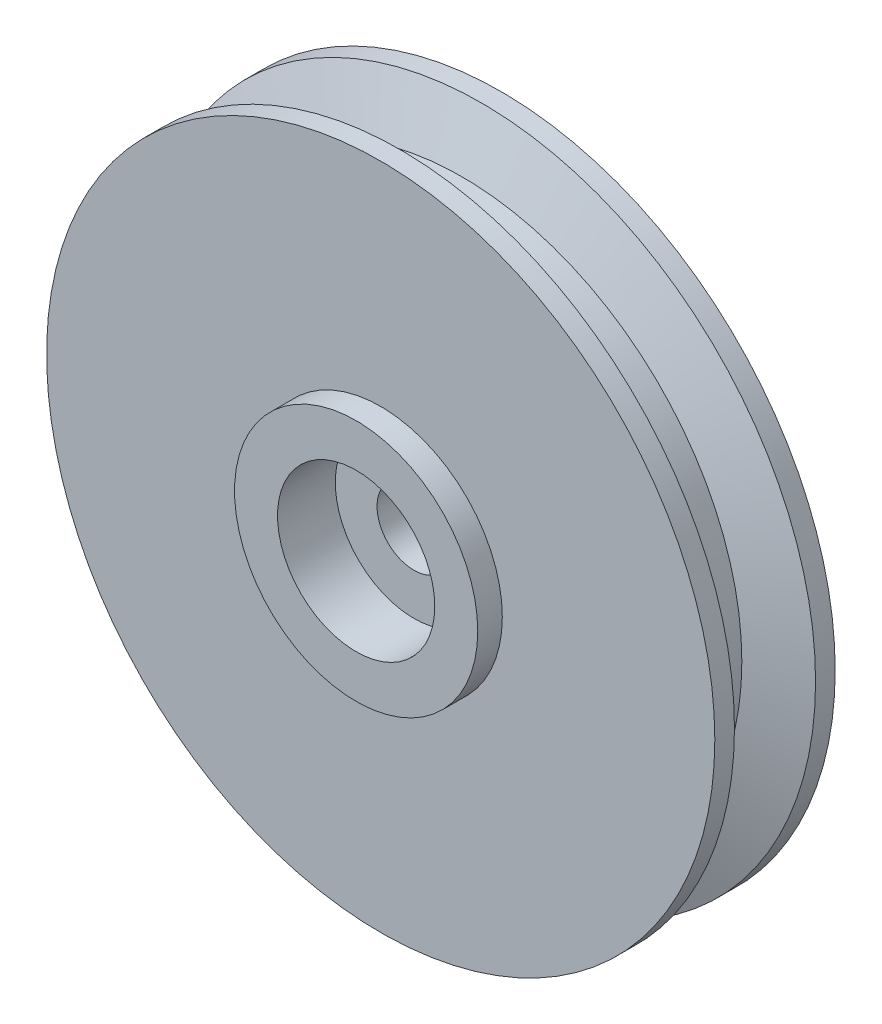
ISO-10303-21;
HEADER;
FILE_DESCRIPTION(('STEP AP214'),'2;1');
FILE_NAME('part.step','',(''),(''),'','','');
FILE_SCHEMA(('AUTOMOTIVE_DESIGN { 1 0 10303 214 1 1 1 1 }'));
ENDSEC;
DATA;
#1=APPLICATION_CONTEXT('core data for automotive mechanical design processes');
#2=APPLICATION_PROTOCOL_DEFINITION('international standard','automotive_design',2000,#1);
#3=PRODUCT_CONTEXT('',#1,'mechanical');
#4=PRODUCT('Part','Part','',(#3));
#5=PRODUCT_RELATED_PRODUCT_CATEGORY('part','',(#4));
#6=PRODUCT_DEFINITION_FORMATION('','',#4);
#7=PRODUCT_DEFINITION_CONTEXT('part definition',#1,'design');
#8=PRODUCT_DEFINITION('design','',#6,#7);
#9=PRODUCT_DEFINITION_SHAPE('','',#8);
#10=(LENGTH_UNIT() NAMED_UNIT(*) SI_UNIT(.MILLI.,.METRE.));
#11=(NAMED_UNIT(*) PLANE_ANGLE_UNIT() SI_UNIT($,.RADIAN.));
#12=(NAMED_UNIT(*) SI_UNIT($,.STERADIAN.) SOLID_ANGLE_UNIT());
#13=UNCERTAINTY_MEASURE_WITH_UNIT(LENGTH_MEASURE(1.E-05),#10,'distance_accuracy_value','');
#14=(GEOMETRIC_REPRESENTATION_CONTEXT(3) GLOBAL_UNCERTAINTY_ASSIGNED_CONTEXT((#13)) GLOBAL_UNIT_ASSIGNED_CONTEXT((#10,
#11,#12)) REPRESENTATION_CONTEXT('',''));
#15=CARTESIAN_POINT('',(0.,0.,0.));
#16=DIRECTION('',(0.,0.,1.));
#17=DIRECTION('',(1.,0.,0.));
#18=AXIS2_PLACEMENT_3D('',#15,#16,#17);
#19=CARTESIAN_POINT('',(0.,0.,40.));
#20=DIRECTION('',(0.,0.,1.));
#21=DIRECTION('',(1.,0.,0.));
#22=AXIS2_PLACEMENT_3D('',#19,#20,#21);
#23=CYLINDRICAL_SURFACE('',#22,24.75);
#24=CARTESIAN_POINT('',(0.,0.,17.25));
#25=DIRECTION('',(0.,0.,1.));
#26=DIRECTION('',(1.,0.,0.));
#27=AXIS2_PLACEMENT_3D('',#24,#25,#26);
#28=CIRCLE('',#27,24.75);
#29=CARTESIAN_POINT('',(24.75,0.,17.25));
#30=VERTEX_POINT('',#29);
#31=EDGE_CURVE('E8',#30,#30,#28,.T.);
#32=ORIENTED_EDGE('',*,*,#31,.F.);
#33=EDGE_LOOP('',(#32));
#34=FACE_BOUND('',#33,.T.);
#35=CARTESIAN_POINT('',(0.,0.,12.25));
#36=DIRECTION('',(0.,0.,1.));
#37=DIRECTION('',(1.,0.,0.));
#38=AXIS2_PLACEMENT_3D('',#35,#36,#37);
#39=CIRCLE('',#38,24.75);
#40=CARTESIAN_POINT('',(24.75,0.,12.25));
#41=VERTEX_POINT('',#40);
#42=EDGE_CURVE('E58',#41,#41,#39,.T.);
#43=ORIENTED_EDGE('',*,*,#42,.T.);
#44=EDGE_LOOP('',(#43));
#45=FACE_BOUND('',#44,.T.);
#46=ADVANCED_FACE('F12',(#34,#45),#23,.T.);
#47=CARTESIAN_POINT('',(0.,24.75,17.25));
#48=DIRECTION('',(0.,0.,-1.));
#49=DIRECTION('',(-1.,0.,0.));
#50=AXIS2_PLACEMENT_3D('',#47,#48,#49);
#51=PLANE('',#50);
#52=CARTESIAN_POINT('',(0.,0.,17.25));
#53=DIRECTION('',(0.,0.,1.));
#54=DIRECTION('',(1.,0.,0.));
#55=AXIS2_PLACEMENT_3D('',#52,#53,#54);
#56=CIRCLE('',#55,16.);
#57=CARTESIAN_POINT('',(16.,0.,17.25));
#58=VERTEX_POINT('',#57);
#59=EDGE_CURVE('E18',#58,#58,#56,.T.);
#60=ORIENTED_EDGE('',*,*,#59,.F.);
#61=EDGE_LOOP('',(#60));
#62=FACE_BOUND('',#61,.T.);
#63=ORIENTED_EDGE('',*,*,#31,.T.);
#64=EDGE_LOOP('',(#63));
#65=FACE_BOUND('',#64,.T.);
#66=ADVANCED_FACE('F76',(#62,#65),#51,.F.);
#67=CARTESIAN_POINT('',(0.,0.,40.));
#68=DIRECTION('',(0.,0.,1.));
#69=DIRECTION('',(1.,0.,0.));
#70=AXIS2_PLACEMENT_3D('',#67,#68,#69);
#71=CYLINDRICAL_SURFACE('',#70,16.);
#72=ORIENTED_EDGE('',*,*,#59,.T.);
#73=EDGE_LOOP('',(#72));
#74=FACE_BOUND('',#73,.T.);
#75=CARTESIAN_POINT('',(0.,0.,5.5));
#76=DIRECTION('',(0.,0.,1.));
#77=DIRECTION('',(1.,0.,0.));
#78=AXIS2_PLACEMENT_3D('',#75,#76,#77);
#79=CIRCLE('',#78,16.);
#80=CARTESIAN_POINT('',(16.,0.,5.5));
#81=VERTEX_POINT('',#80);
#82=EDGE_CURVE('E22',#81,#81,#79,.T.);
#83=ORIENTED_EDGE('',*,*,#82,.F.);
#84=EDGE_LOOP('',(#83));
#85=FACE_BOUND('',#84,.T.);
#86=ADVANCED_FACE('F81',(#74,#85),#71,.F.);
#87=CARTESIAN_POINT('',(0.,7.5,5.5));
#88=DIRECTION('',(0.,0.,1.));
#89=DIRECTION('',(1.,0.,0.));
#90=AXIS2_PLACEMENT_3D('',#87,#88,#89);
#91=PLANE('',#90);
#92=ORIENTED_EDGE('',*,*,#82,.T.);
#93=EDGE_LOOP('',(#92));
#94=FACE_BOUND('',#93,.T.);
#95=CARTESIAN_POINT('',(0.,0.,5.5));
#96=DIRECTION('',(0.,0.,1.));
#97=DIRECTION('',(1.,0.,0.));
#98=AXIS2_PLACEMENT_3D('',#95,#96,#97);
#99=CIRCLE('',#98,7.5);
#100=CARTESIAN_POINT('',(7.5,0.,5.5));
#101=VERTEX_POINT('',#100);
#102=EDGE_CURVE('E26',#101,#101,#99,.T.);
#103=ORIENTED_EDGE('',*,*,#102,.F.);
#104=EDGE_LOOP('',(#103));
#105=FACE_BOUND('',#104,.T.);
#106=ADVANCED_FACE('F86',(#94,#105),#91,.T.);
#107=CARTESIAN_POINT('',(0.,0.,40.));
#108=DIRECTION('',(0.,0.,1.));
#109=DIRECTION('',(1.,0.,0.));
#110=AXIS2_PLACEMENT_3D('',#107,#108,#109);
#111=CYLINDRICAL_SURFACE('',#110,7.5);
#112=CARTESIAN_POINT('',(0.,0.,-5.5));
#113=DIRECTION('',(0.,0.,1.));
#114=DIRECTION('',(1.,0.,0.));
#115=AXIS2_PLACEMENT_3D('',#112,#113,#114);
#116=CIRCLE('',#115,7.5);
#117=CARTESIAN_POINT('',(7.5,0.,-5.5));
#118=VERTEX_POINT('',#117);
#119=EDGE_CURVE('E31',#118,#118,#116,.T.);
#120=ORIENTED_EDGE('',*,*,#119,.F.);
#121=EDGE_LOOP('',(#120));
#122=FACE_BOUND('',#121,.T.);
#123=ORIENTED_EDGE('',*,*,#102,.T.);
#124=EDGE_LOOP('',(#123));
#125=FACE_BOUND('',#124,.T.);
#126=ADVANCED_FACE('F91',(#122,#125),#111,.F.);
#127=CARTESIAN_POINT('',(0.,7.5,-5.5));
#128=DIRECTION('',(0.,0.,1.));
#129=DIRECTION('',(1.,0.,0.));
#130=AXIS2_PLACEMENT_3D('',#127,#128,#129);
#131=PLANE('',#130);
#132=CARTESIAN_POINT('',(0.,0.,-5.5));
#133=DIRECTION('',(0.,0.,1.));
#134=DIRECTION('',(1.,0.,0.));
#135=AXIS2_PLACEMENT_3D('',#132,#133,#134);
#136=CIRCLE('',#135,16.);
#137=CARTESIAN_POINT('',(16.,0.,-5.5));
#138=VERTEX_POINT('',#137);
#139=EDGE_CURVE('E34',#138,#138,#136,.T.);
#140=ORIENTED_EDGE('',*,*,#139,.F.);
#141=EDGE_LOOP('',(#140));
#142=FACE_BOUND('',#141,.T.);
#143=ORIENTED_EDGE('',*,*,#119,.T.);
#144=EDGE_LOOP('',(#143));
#145=FACE_BOUND('',#144,.T.);
#146=ADVANCED_FACE('F95',(#142,#145),#131,.F.);
#147=CARTESIAN_POINT('',(0.,0.,40.));
#148=DIRECTION('',(0.,0.,1.));
#149=DIRECTION('',(1.,0.,0.));
#150=AXIS2_PLACEMENT_3D('',#147,#148,#149);
#151=CYLINDRICAL_SURFACE('',#150,16.);
#152=CARTESIAN_POINT('',(0.,0.,-12.25));
#153=DIRECTION('',(0.,0.,1.));
#154=DIRECTION('',(1.,0.,0.));
#155=AXIS2_PLACEMENT_3D('',#152,#153,#154);
#156=CIRCLE('',#155,16.);
#157=CARTESIAN_POINT('',(16.,0.,-12.25));
#158=VERTEX_POINT('',#157);
#159=EDGE_CURVE('E37',#158,#158,#156,.T.);
#160=ORIENTED_EDGE('',*,*,#159,.F.);
#161=EDGE_LOOP('',(#160));
#162=FACE_BOUND('',#161,.T.);
#163=ORIENTED_EDGE('',*,*,#139,.T.);
#164=EDGE_LOOP('',(#163));
#165=FACE_BOUND('',#164,.T.);
#166=ADVANCED_FACE('F99',(#162,#165),#151,.F.);
#167=CARTESIAN_POINT('',(0.,16.,-12.25));
#168=DIRECTION('',(0.,0.,1.));
#169=DIRECTION('',(1.,0.,0.));
#170=AXIS2_PLACEMENT_3D('',#167,#168,#169);
#171=PLANE('',#170);
#172=CARTESIAN_POINT('',(0.,0.,-12.25));
#173=DIRECTION('',(0.,0.,1.));
#174=DIRECTION('',(1.,0.,0.));
#175=AXIS2_PLACEMENT_3D('',#172,#173,#174);
#176=CIRCLE('',#175,68.);
#177=CARTESIAN_POINT('',(68.,0.,-12.25));
#178=VERTEX_POINT('',#177);
#179=EDGE_CURVE('E40',#178,#178,#176,.T.);
#180=ORIENTED_EDGE('',*,*,#179,.F.);
#181=EDGE_LOOP('',(#180));
#182=FACE_BOUND('',#181,.T.);
#183=ORIENTED_EDGE('',*,*,#159,.T.);
#184=EDGE_LOOP('',(#183));
#185=FACE_BOUND('',#184,.T.);
#186=ADVANCED_FACE('F103',(#182,#185),#171,.F.);
#187=CARTESIAN_POINT('',(0.,0.,40.));
#188=DIRECTION('',(0.,0.,1.));
#189=DIRECTION('',(1.,0.,0.));
#190=AXIS2_PLACEMENT_3D('',#187,#188,#189);
#191=CYLINDRICAL_SURFACE('',#190,68.);
#192=CARTESIAN_POINT('',(0.,0.,-8.2536725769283));
#193=DIRECTION('',(0.,0.,1.));
#194=DIRECTION('',(1.,0.,0.));
#195=AXIS2_PLACEMENT_3D('',#192,#193,#194);
#196=CIRCLE('',#195,68.);
#197=CARTESIAN_POINT('',(68.,0.,-8.2536725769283));
#198=VERTEX_POINT('',#197);
#199=EDGE_CURVE('E43',#198,#198,#196,.T.);
#200=ORIENTED_EDGE('',*,*,#199,.F.);
#201=EDGE_LOOP('',(#200));
#202=FACE_BOUND('',#201,.T.);
#203=ORIENTED_EDGE('',*,*,#179,.T.);
#204=EDGE_LOOP('',(#203));
#205=FACE_BOUND('',#204,.T.);
#206=ADVANCED_FACE('F107',(#202,#205),#191,.T.);
#207=CARTESIAN_POINT('',(0.,0.,-4.25));
#208=DIRECTION('',(0.,0.,-1.));
#209=DIRECTION('',(-1.,0.,0.));
#210=AXIS2_PLACEMENT_3D('',#207,#208,#209);
#211=CONICAL_SURFACE('',#210,57.,1.22173047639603);
#212=ORIENTED_EDGE('',*,*,#199,.T.);
#213=EDGE_LOOP('',(#212));
#214=FACE_BOUND('',#213,.T.);
#215=CARTESIAN_POINT('',(0.,0.,-4.25));
#216=DIRECTION('',(0.,0.,1.));
#217=DIRECTION('',(1.,0.,0.));
#218=AXIS2_PLACEMENT_3D('',#215,#216,#217);
#219=CIRCLE('',#218,57.);
#220=CARTESIAN_POINT('',(57.,0.,-4.25));
#221=VERTEX_POINT('',#220);
#222=EDGE_CURVE('E46',#221,#221,#219,.T.);
#223=ORIENTED_EDGE('',*,*,#222,.F.);
#224=EDGE_LOOP('',(#223));
#225=FACE_BOUND('',#224,.T.);
#226=ADVANCED_FACE('F111',(#214,#225),#211,.T.);
#227=CARTESIAN_POINT('',(0.,0.,40.));
#228=DIRECTION('',(0.,0.,1.));
#229=DIRECTION('',(1.,0.,0.));
#230=AXIS2_PLACEMENT_3D('',#227,#228,#229);
#231=CYLINDRICAL_SURFACE('',#230,57.);
#232=CARTESIAN_POINT('',(0.,0.,4.25));
#233=DIRECTION('',(0.,0.,1.));
#234=DIRECTION('',(1.,0.,0.));
#235=AXIS2_PLACEMENT_3D('',#232,#233,#234);
#236=CIRCLE('',#235,57.);
#237=CARTESIAN_POINT('',(57.,0.,4.25));
#238=VERTEX_POINT('',#237);
#239=EDGE_CURVE('E49',#238,#238,#236,.T.);
#240=ORIENTED_EDGE('',*,*,#239,.F.);
#241=EDGE_LOOP('',(#240));
#242=FACE_BOUND('',#241,.T.);
#243=ORIENTED_EDGE('',*,*,#222,.T.);
#244=EDGE_LOOP('',(#243));
#245=FACE_BOUND('',#244,.T.);
#246=ADVANCED_FACE('F115',(#242,#245),#231,.T.);
#247=CARTESIAN_POINT('',(0.,0.,4.25));
#248=DIRECTION('',(0.,0.,1.));
#249=DIRECTION('',(1.,0.,0.));
#250=AXIS2_PLACEMENT_3D('',#247,#248,#249);
#251=CONICAL_SURFACE('',#250,57.,1.22173047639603);
#252=CARTESIAN_POINT('',(0.,0.,8.25367257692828));
#253=DIRECTION('',(0.,0.,1.));
#254=DIRECTION('',(1.,0.,0.));
#255=AXIS2_PLACEMENT_3D('',#252,#253,#254);
#256=CIRCLE('',#255,68.);
#257=CARTESIAN_POINT('',(68.,0.,8.25367257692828));
#258=VERTEX_POINT('',#257);
#259=EDGE_CURVE('E52',#258,#258,#256,.T.);
#260=ORIENTED_EDGE('',*,*,#259,.F.);
#261=EDGE_LOOP('',(#260));
#262=FACE_BOUND('',#261,.T.);
#263=ORIENTED_EDGE('',*,*,#239,.T.);
#264=EDGE_LOOP('',(#263));
#265=FACE_BOUND('',#264,.T.);
#266=ADVANCED_FACE('F72',(#262,#265),#251,.T.);
#267=CARTESIAN_POINT('',(0.,0.,40.));
#268=DIRECTION('',(0.,0.,1.));
#269=DIRECTION('',(1.,0.,0.));
#270=AXIS2_PLACEMENT_3D('',#267,#268,#269);
#271=CYLINDRICAL_SURFACE('',#270,68.);
#272=ORIENTED_EDGE('',*,*,#259,.T.);
#273=EDGE_LOOP('',(#272));
#274=FACE_BOUND('',#273,.T.);
#275=CARTESIAN_POINT('',(0.,0.,12.25));
#276=DIRECTION('',(0.,0.,1.));
#277=DIRECTION('',(1.,0.,0.));
#278=AXIS2_PLACEMENT_3D('',#275,#276,#277);
#279=CIRCLE('',#278,68.);
#280=CARTESIAN_POINT('',(68.,0.,12.25));
#281=VERTEX_POINT('',#280);
#282=EDGE_CURVE('E55',#281,#281,#279,.T.);
#283=ORIENTED_EDGE('',*,*,#282,.F.);
#284=EDGE_LOOP('',(#283));
#285=FACE_BOUND('',#284,.T.);
#286=ADVANCED_FACE('F65',(#274,#285),#271,.T.);
#287=CARTESIAN_POINT('',(0.,24.75,12.25));
#288=DIRECTION('',(0.,0.,1.));
#289=DIRECTION('',(1.,0.,0.));
#290=AXIS2_PLACEMENT_3D('',#287,#288,#289);
#291=PLANE('',#290);
#292=ORIENTED_EDGE('',*,*,#282,.T.);
#293=EDGE_LOOP('',(#292));
#294=FACE_BOUND('',#293,.T.);
#295=ORIENTED_EDGE('',*,*,#42,.F.);
#296=EDGE_LOOP('',(#295));
#297=FACE_BOUND('',#296,.T.);
#298=ADVANCED_FACE('F63',(#294,#297),#291,.T.);
#299=CLOSED_SHELL('',(#46,#66,#86,#106,#126,#146,#166,#186,#206,#226,#246,#266,#286,#298));
#300=MANIFOLD_SOLID_BREP('B1',#299);
#301=ADVANCED_BREP_SHAPE_REPRESENTATION('',(#18,#300),#14);
#302=SHAPE_DEFINITION_REPRESENTATION(#9,#301);
ENDSEC;
END-ISO-10303-21;
